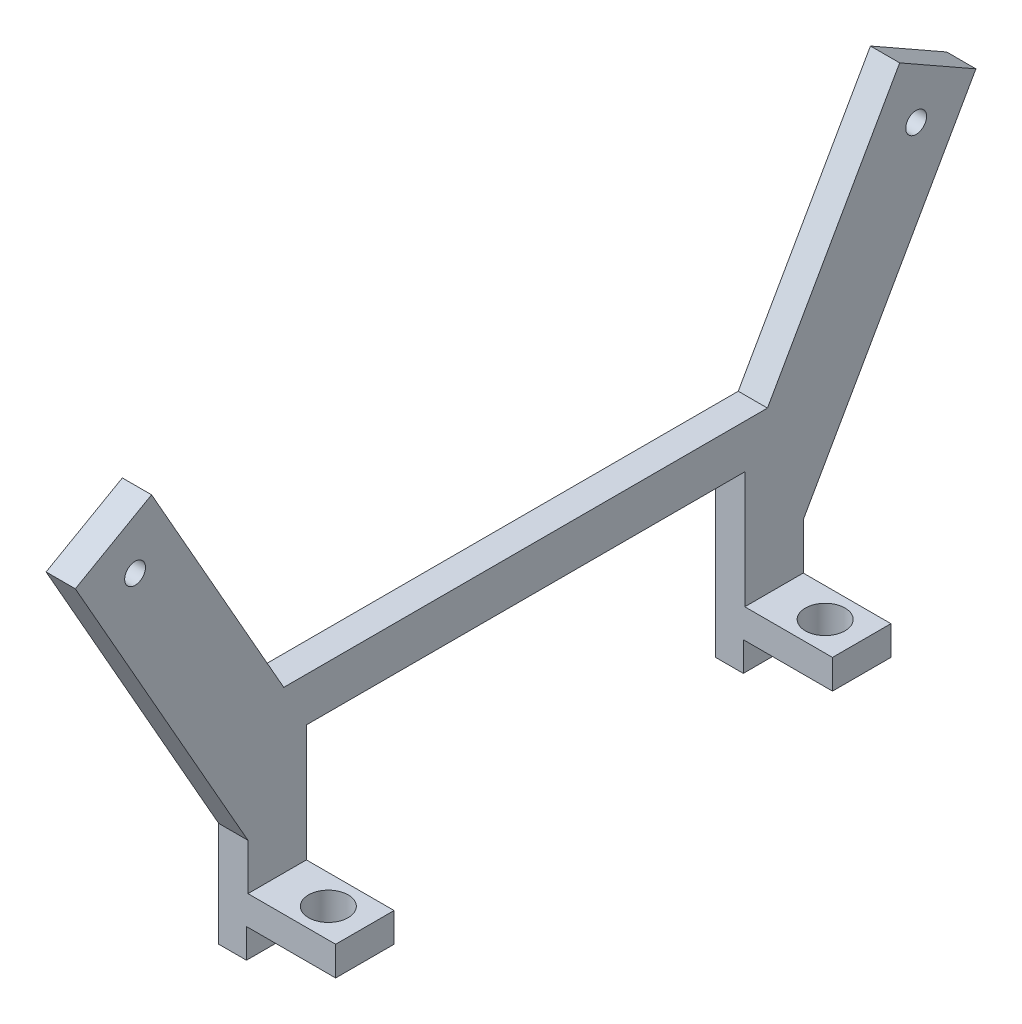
from build123d import *

# Parameters (mm, degrees)
EXTRUDE1_DEPTH               = 3.175
F_4_40_TAPPED_HOLE1_D        = 2.2606
SKETCH5_W                    = 3.0125
SKETCH5_H                    = 6.35
EXTRUDE2_DEPTH               = 3.175
SKETCH6_W                    = 6.35
SKETCH6_H                    = 3.175
EXTRUDE3_DEPTH               = 9.525
F_18_0_1695_DIAMETER_HOLE1_D = 4.3053


with BuildPart() as part:
    # Sketch2 → Extrude1 (new body)
    with BuildSketch(Plane(origin=(-30, 0, 0), x_dir=(0, 0, -1), z_dir=(1, 0, 0))):
        Polygon((-48.919242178, -40.635903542), (-40.635903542, -35.933571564), (-26.274307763, -61.232074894), (26.274307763, -61.232074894), (40.635903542, -35.933571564), (48.919242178, -40.635903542), (30.1625, -73.676626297), (30.1625, -81.869574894), (23.8125, -81.869574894), (23.8125, -65.994574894), (-23.8125, -65.994574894), (-23.8125, -81.869574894), (-30.1625, -81.869574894), (-30.1625, -73.676626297), align=None)
    extrude(amount=EXTRUDE1_DEPTH)

    # 4-40 Tapped Hole1 (through all)
    with Locations(Plane(origin=(-26.825, 0, 0), x_dir=(0, 0, -1), z_dir=(1, 0, 0))):
        with Locations((-42.426406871, -42.426406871), (42.426406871, -42.426406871)):
            Hole(F_4_40_TAPPED_HOLE1_D / 2)

    # Sketch5 → Extrude2 (add)
    with BuildSketch(Plane.XZ.offset(81.869574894)):
        with Locations((-28.49375, 26.9875)):
            Rectangle(SKETCH5_W, SKETCH5_H)
        with Locations((-28.49375, -26.9875)):
            Rectangle(SKETCH5_W, SKETCH5_H)
    extrude(amount=EXTRUDE2_DEPTH)

    # Sketch6 → Extrude3 (add)
    with BuildSketch(Plane(origin=(-26.825, 0, 0), x_dir=(0, 0, -1), z_dir=(1, 0, 0))):
        with Locations((-26.9875, -80.282074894)):
            Rectangle(SKETCH6_W, SKETCH6_H)
        with Locations((26.9875, -80.282074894)):
            Rectangle(SKETCH6_W, SKETCH6_H)
    extrude(amount=EXTRUDE3_DEPTH)

    # 18 _0.1695_ Diameter Hole1 (through all)
    with Locations(Plane(origin=(0, -78.694574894, 0), x_dir=(-1, 0, 0), z_dir=(0, 1, 0))):
        with Locations((21.26875, 26.9875), (21.26875, -26.9875)):
            Hole(F_18_0_1695_DIAMETER_HOLE1_D / 2)


solid = part.part
